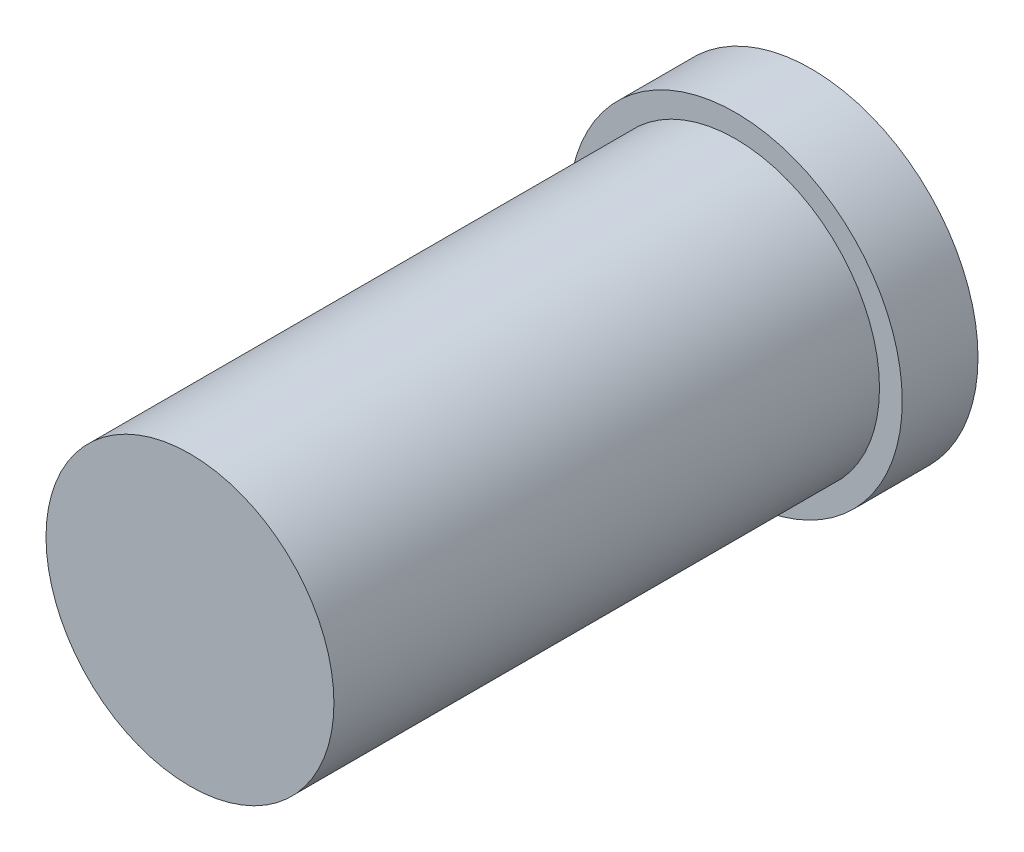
from build123d import *

# Parameters (mm, degrees)
SKETCH1_R           = 11
BOSS_EXTRUDE1_DEPTH = 5
SKETCH3_R           = 9.5
BOSS_EXTRUDE2_DEPTH = 36


with BuildPart() as part:
    # Sketch1 → Boss-Extrude1 (new body)
    with BuildSketch(Plane.XY):
        Circle(SKETCH1_R)
    extrude(amount=BOSS_EXTRUDE1_DEPTH)

    # Sketch3 → Boss-Extrude2 (add)
    with BuildSketch(Plane.XY.offset(5)):
        Circle(SKETCH3_R)
    extrude(amount=BOSS_EXTRUDE2_DEPTH)


solid = part.part
